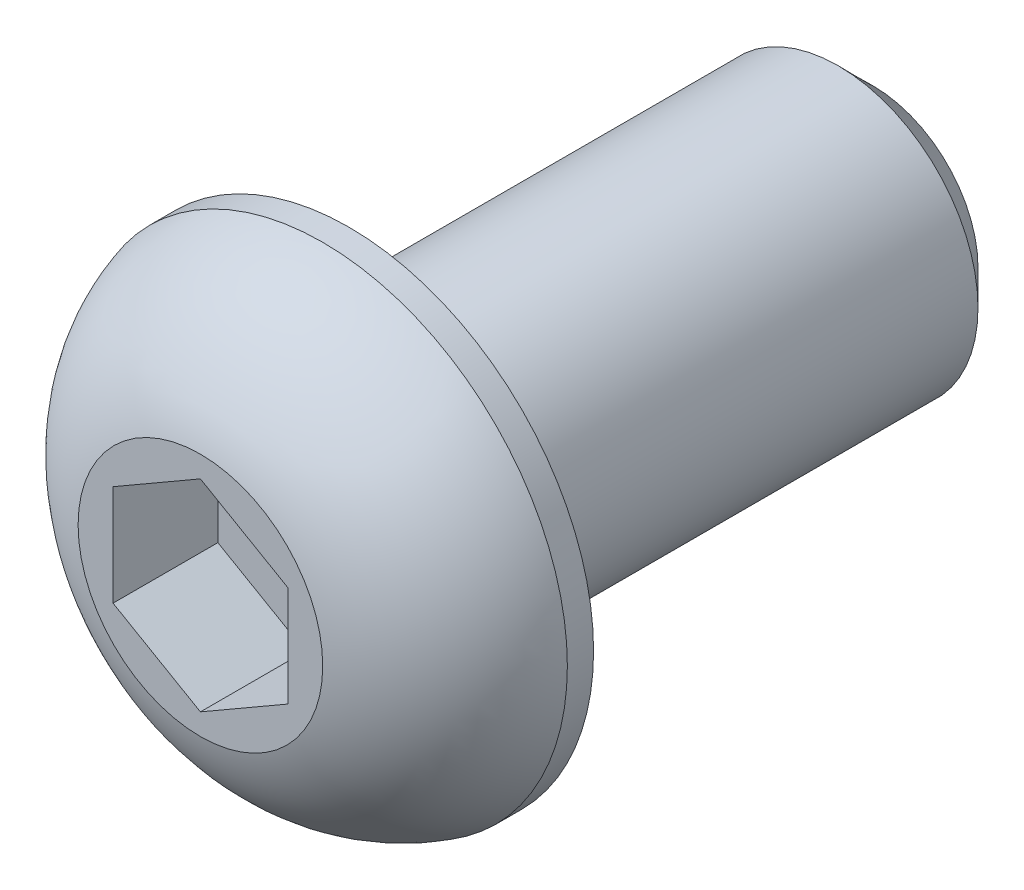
ISO-10303-21;
HEADER;
FILE_DESCRIPTION(('STEP AP214'),'2;1');
FILE_NAME('part.step','',(''),(''),'','','');
FILE_SCHEMA(('AUTOMOTIVE_DESIGN { 1 0 10303 214 1 1 1 1 }'));
ENDSEC;
DATA;
#1=APPLICATION_CONTEXT('core data for automotive mechanical design processes');
#2=APPLICATION_PROTOCOL_DEFINITION('international standard','automotive_design',2000,#1);
#3=PRODUCT_CONTEXT('',#1,'mechanical');
#4=PRODUCT('Part','Part','',(#3));
#5=PRODUCT_RELATED_PRODUCT_CATEGORY('part','',(#4));
#6=PRODUCT_DEFINITION_FORMATION('','',#4);
#7=PRODUCT_DEFINITION_CONTEXT('part definition',#1,'design');
#8=PRODUCT_DEFINITION('design','',#6,#7);
#9=PRODUCT_DEFINITION_SHAPE('','',#8);
#10=(LENGTH_UNIT() NAMED_UNIT(*) SI_UNIT(.MILLI.,.METRE.));
#11=(NAMED_UNIT(*) PLANE_ANGLE_UNIT() SI_UNIT($,.RADIAN.));
#12=(NAMED_UNIT(*) SI_UNIT($,.STERADIAN.) SOLID_ANGLE_UNIT());
#13=UNCERTAINTY_MEASURE_WITH_UNIT(LENGTH_MEASURE(1.E-05),#10,'distance_accuracy_value','');
#14=(GEOMETRIC_REPRESENTATION_CONTEXT(3) GLOBAL_UNCERTAINTY_ASSIGNED_CONTEXT((#13)) GLOBAL_UNIT_ASSIGNED_CONTEXT((#10,
#11,#12)) REPRESENTATION_CONTEXT('',''));
#15=CARTESIAN_POINT('',(0.,0.,0.));
#16=DIRECTION('',(0.,0.,1.));
#17=DIRECTION('',(1.,0.,0.));
#18=AXIS2_PLACEMENT_3D('',#15,#16,#17);
#19=CARTESIAN_POINT('',(0.,-5.60133932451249E-13,8.50000000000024));
#20=DIRECTION('',(0.,0.,1.));
#21=DIRECTION('',(0.,-1.,0.));
#22=AXIS2_PLACEMENT_3D('',#19,#20,#21);
#23=PLANE('',#22);
#24=CARTESIAN_POINT('',(0.,3.45415925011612E-13,8.50000000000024));
#25=DIRECTION('',(0.,0.,1.));
#26=DIRECTION('',(0.,-1.,0.));
#27=AXIS2_PLACEMENT_3D('',#24,#25,#26);
#28=CIRCLE('',#27,6.99999999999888);
#29=CARTESIAN_POINT('',(0.,-6.99999999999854,8.50000000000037));
#30=VERTEX_POINT('',#29);
#31=EDGE_CURVE('E124',#30,#30,#28,.T.);
#32=ORIENTED_EDGE('',*,*,#31,.T.);
#33=EDGE_LOOP('',(#32));
#34=FACE_BOUND('',#33,.T.);
#35=DIRECTION('',(0.,-1.,0.));
#36=VECTOR('',#35,1.);
#37=CARTESIAN_POINT('',(5.,2.88675134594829,8.50000000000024));
#38=LINE('',#37,#36);
#39=CARTESIAN_POINT('',(5.,2.88675134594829,8.50000000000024));
#40=VERTEX_POINT('',#39);
#41=CARTESIAN_POINT('',(5.,-2.88675134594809,8.50000000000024));
#42=VERTEX_POINT('',#41);
#43=EDGE_CURVE('E85',#40,#42,#38,.T.);
#44=ORIENTED_EDGE('',*,*,#43,.T.);
#45=DIRECTION('',(-0.86602540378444,-0.5,0.));
#46=VECTOR('',#45,1.);
#47=CARTESIAN_POINT('',(5.,-2.88675134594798,8.50000000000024));
#48=LINE('',#47,#46);
#49=CARTESIAN_POINT('',(0.,-5.77350269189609,8.50000000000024));
#50=VERTEX_POINT('',#49);
#51=EDGE_CURVE('E30',#42,#50,#48,.T.);
#52=ORIENTED_EDGE('',*,*,#51,.T.);
#53=DIRECTION('',(0.86602540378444,-0.5,0.));
#54=VECTOR('',#53,1.);
#55=CARTESIAN_POINT('',(-5.,-2.88675134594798,8.50000000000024));
#56=LINE('',#55,#54);
#57=CARTESIAN_POINT('',(-5.,-2.88675134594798,8.50000000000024));
#58=VERTEX_POINT('',#57);
#59=EDGE_CURVE('E75',#58,#50,#56,.T.);
#60=ORIENTED_EDGE('',*,*,#59,.F.);
#61=DIRECTION('',(0.,-1.,0.));
#62=VECTOR('',#61,1.);
#63=CARTESIAN_POINT('',(-5.,2.88675134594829,8.50000000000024));
#64=LINE('',#63,#62);
#65=CARTESIAN_POINT('',(-5.,2.88675134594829,8.50000000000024));
#66=VERTEX_POINT('',#65);
#67=EDGE_CURVE('E80',#66,#58,#64,.T.);
#68=ORIENTED_EDGE('',*,*,#67,.F.);
#69=DIRECTION('',(0.86602540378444,0.5,0.));
#70=VECTOR('',#69,1.);
#71=CARTESIAN_POINT('',(-5.,2.88675134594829,8.50000000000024));
#72=LINE('',#71,#70);
#73=CARTESIAN_POINT('',(0.,5.77350269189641,8.50000000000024));
#74=VERTEX_POINT('',#73);
#75=EDGE_CURVE('E89',#66,#74,#72,.T.);
#76=ORIENTED_EDGE('',*,*,#75,.T.);
#77=DIRECTION('',(-0.86602540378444,0.5,0.));
#78=VECTOR('',#77,1.);
#79=CARTESIAN_POINT('',(5.,2.88675134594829,8.50000000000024));
#80=LINE('',#79,#78);
#81=EDGE_CURVE('E92',#40,#74,#80,.T.);
#82=ORIENTED_EDGE('',*,*,#81,.F.);
#83=EDGE_LOOP('',(#44,#52,#60,#68,#76,#82));
#84=FACE_BOUND('',#83,.T.);
#85=ADVANCED_FACE('F15',(#34,#84),#23,.T.);
#86=CARTESIAN_POINT('',(0.,5.63411768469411E-13,20.1755563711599));
#87=DIRECTION('',(0.,0.,1.));
#88=DIRECTION('',(0.,-1.,0.));
#89=AXIS2_PLACEMENT_3D('',#86,#87,#88);
#90=CYLINDRICAL_SURFACE('',#89,7.99999999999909);
#91=CARTESIAN_POINT('',(0.,1.86711310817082E-13,-1.07552855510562E-13));
#92=DIRECTION('',(0.,0.,1.));
#93=DIRECTION('',(0.,-1.,0.));
#94=AXIS2_PLACEMENT_3D('',#91,#92,#93);
#95=CIRCLE('',#94,7.99999999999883);
#96=CARTESIAN_POINT('',(0.,-7.99999999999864,0.));
#97=VERTEX_POINT('',#96);
#98=EDGE_CURVE('E10',#97,#97,#95,.T.);
#99=ORIENTED_EDGE('',*,*,#98,.F.);
#100=EDGE_LOOP('',(#99));
#101=FACE_BOUND('',#100,.T.);
#102=CARTESIAN_POINT('',(0.,-3.36080359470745E-13,-27.9999999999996));
#103=DIRECTION('',(0.,0.,1.));
#104=DIRECTION('',(0.,-1.,0.));
#105=AXIS2_PLACEMENT_3D('',#102,#103,#104);
#106=CIRCLE('',#105,7.99999999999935);
#107=CARTESIAN_POINT('',(0.,-7.99999999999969,-27.9999999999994));
#108=VERTEX_POINT('',#107);
#109=EDGE_CURVE('E71',#108,#108,#106,.T.);
#110=ORIENTED_EDGE('',*,*,#109,.T.);
#111=EDGE_LOOP('',(#110));
#112=FACE_BOUND('',#111,.T.);
#113=ADVANCED_FACE('F17',(#101,#112),#90,.T.);
#114=CARTESIAN_POINT('',(0.,13.9999999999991,-2.60208521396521E-13));
#115=DIRECTION('',(0.,0.,-1.));
#116=DIRECTION('',(0.,1.,0.));
#117=AXIS2_PLACEMENT_3D('',#114,#115,#116);
#118=PLANE('',#117);
#119=ORIENTED_EDGE('',*,*,#98,.T.);
#120=EDGE_LOOP('',(#119));
#121=FACE_BOUND('',#120,.T.);
#122=CARTESIAN_POINT('',(0.,1.86711310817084E-13,2.393918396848E-13));
#123=DIRECTION('',(0.,0.,1.));
#124=DIRECTION('',(0.,-1.,0.));
#125=AXIS2_PLACEMENT_3D('',#122,#123,#124);
#126=CIRCLE('',#125,13.9999999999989);
#127=CARTESIAN_POINT('',(0.,-13.9999999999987,5.00787674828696E-13));
#128=VERTEX_POINT('',#127);
#129=EDGE_CURVE('E23',#128,#128,#126,.T.);
#130=ORIENTED_EDGE('',*,*,#129,.F.);
#131=EDGE_LOOP('',(#130));
#132=FACE_BOUND('',#131,.T.);
#133=ADVANCED_FACE('F134',(#121,#132),#118,.T.);
#134=CARTESIAN_POINT('',(0.,5.63411768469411E-13,20.1755563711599));
#135=DIRECTION('',(0.,0.,1.));
#136=DIRECTION('',(0.,-1.,0.));
#137=AXIS2_PLACEMENT_3D('',#134,#135,#136);
#138=CYLINDRICAL_SURFACE('',#137,13.9999999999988);
#139=CARTESIAN_POINT('',(0.,2.14718007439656E-13,1.50000000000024));
#140=DIRECTION('',(0.,0.,1.));
#141=DIRECTION('',(0.,-1.,0.));
#142=AXIS2_PLACEMENT_3D('',#139,#140,#141);
#143=CIRCLE('',#142,13.9999999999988);
#144=CARTESIAN_POINT('',(0.,-13.9999999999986,1.5000000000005));
#145=VERTEX_POINT('',#144);
#146=EDGE_CURVE('E127',#145,#145,#143,.T.);
#147=ORIENTED_EDGE('',*,*,#146,.F.);
#148=EDGE_LOOP('',(#147));
#149=FACE_BOUND('',#148,.T.);
#150=ORIENTED_EDGE('',*,*,#129,.T.);
#151=EDGE_LOOP('',(#150));
#152=FACE_BOUND('',#151,.T.);
#153=ADVANCED_FACE('F132',(#149,#152),#138,.T.);
#154=CARTESIAN_POINT('',(0.,1.64980480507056E-13,-1.14410286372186));
#155=DIRECTION('',(0.,0.,1.));
#156=DIRECTION('',(0.,-1.,0.));
#157=AXIS2_PLACEMENT_3D('',#154,#155,#156);
#158=DEGENERATE_TOROIDAL_SURFACE('',#157,4.35589713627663,10.,.T.);
#159=ORIENTED_EDGE('',*,*,#31,.F.);
#160=EDGE_LOOP('',(#159));
#161=FACE_BOUND('',#160,.T.);
#162=ORIENTED_EDGE('',*,*,#146,.T.);
#163=EDGE_LOOP('',(#162));
#164=FACE_BOUND('',#163,.T.);
#165=ADVANCED_FACE('F143',(#161,#164),#158,.T.);
#166=CARTESIAN_POINT('',(0.,-5.60133932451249E-13,-30.));
#167=DIRECTION('',(0.,0.,1.));
#168=DIRECTION('',(0.,-1.,0.));
#169=AXIS2_PLACEMENT_3D('',#166,#167,#168);
#170=PLANE('',#169);
#171=CARTESIAN_POINT('',(0.,-3.73422621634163E-13,-29.9999999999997));
#172=DIRECTION('',(0.,0.,1.));
#173=DIRECTION('',(0.,-1.,0.));
#174=AXIS2_PLACEMENT_3D('',#171,#172,#173);
#175=CIRCLE('',#174,5.99999999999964);
#176=CARTESIAN_POINT('',(0.,-6.00000000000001,-29.9999999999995));
#177=VERTEX_POINT('',#176);
#178=EDGE_CURVE('E121',#177,#177,#175,.T.);
#179=ORIENTED_EDGE('',*,*,#178,.F.);
#180=EDGE_LOOP('',(#179));
#181=FACE_BOUND('',#180,.T.);
#182=ADVANCED_FACE('F155',(#181),#170,.F.);
#183=CARTESIAN_POINT('',(0.,-3.73422621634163E-13,-29.9999999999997));
#184=DIRECTION('',(0.,0.,1.));
#185=DIRECTION('',(0.,-1.,0.));
#186=AXIS2_PLACEMENT_3D('',#183,#184,#185);
#187=CONICAL_SURFACE('',#186,5.99999999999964,0.785398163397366);
#188=ORIENTED_EDGE('',*,*,#109,.F.);
#189=EDGE_LOOP('',(#188));
#190=FACE_BOUND('',#189,.T.);
#191=ORIENTED_EDGE('',*,*,#178,.T.);
#192=EDGE_LOOP('',(#191));
#193=FACE_BOUND('',#192,.T.);
#194=ADVANCED_FACE('F163',(#190,#193),#187,.T.);
#195=CARTESIAN_POINT('',(5.,-2.88675134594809,2.50000000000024));
#196=DIRECTION('',(-0.5,0.86602540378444,0.));
#197=DIRECTION('',(-0.86602540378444,-0.5,0.));
#198=AXIS2_PLACEMENT_3D('',#195,#196,#197);
#199=PLANE('',#198);
#200=DIRECTION('',(0.,0.,1.));
#201=VECTOR('',#200,1.);
#202=CARTESIAN_POINT('',(0.,-5.7735026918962,2.50000000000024));
#203=LINE('',#202,#201);
#204=CARTESIAN_POINT('',(0.,-5.7735026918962,2.50000000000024));
#205=VERTEX_POINT('',#204);
#206=EDGE_CURVE('E64',#205,#50,#203,.T.);
#207=ORIENTED_EDGE('',*,*,#206,.T.);
#208=ORIENTED_EDGE('',*,*,#51,.F.);
#209=DIRECTION('',(0.,0.,1.));
#210=VECTOR('',#209,1.);
#211=CARTESIAN_POINT('',(5.,-2.88675134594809,2.50000000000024));
#212=LINE('',#211,#210);
#213=CARTESIAN_POINT('',(5.,-2.88675134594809,2.50000000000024));
#214=VERTEX_POINT('',#213);
#215=EDGE_CURVE('E34',#214,#42,#212,.T.);
#216=ORIENTED_EDGE('',*,*,#215,.F.);
#217=DIRECTION('',(-0.86602540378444,-0.5,0.));
#218=VECTOR('',#217,1.);
#219=CARTESIAN_POINT('',(5.,-2.88675134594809,2.50000000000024));
#220=LINE('',#219,#218);
#221=EDGE_CURVE('E67',#214,#205,#220,.T.);
#222=ORIENTED_EDGE('',*,*,#221,.T.);
#223=EDGE_LOOP('',(#207,#208,#216,#222));
#224=FACE_BOUND('',#223,.T.);
#225=ADVANCED_FACE('F66',(#224),#199,.T.);
#226=CARTESIAN_POINT('',(-5.,-2.88675134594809,2.50000000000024));
#227=DIRECTION('',(-0.5,-0.86602540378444,0.));
#228=DIRECTION('',(0.86602540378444,-0.5,0.));
#229=AXIS2_PLACEMENT_3D('',#226,#227,#228);
#230=PLANE('',#229);
#231=DIRECTION('',(0.,0.,1.));
#232=VECTOR('',#231,1.);
#233=CARTESIAN_POINT('',(-5.,-2.88675134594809,2.50000000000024));
#234=LINE('',#233,#232);
#235=CARTESIAN_POINT('',(-5.,-2.88675134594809,2.50000000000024));
#236=VERTEX_POINT('',#235);
#237=EDGE_CURVE('E72',#236,#58,#234,.T.);
#238=ORIENTED_EDGE('',*,*,#237,.T.);
#239=ORIENTED_EDGE('',*,*,#59,.T.);
#240=ORIENTED_EDGE('',*,*,#206,.F.);
#241=DIRECTION('',(0.86602540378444,-0.5,0.));
#242=VECTOR('',#241,1.);
#243=CARTESIAN_POINT('',(-5.,-2.88675134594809,2.50000000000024));
#244=LINE('',#243,#242);
#245=EDGE_CURVE('E97',#236,#205,#244,.T.);
#246=ORIENTED_EDGE('',*,*,#245,.F.);
#247=EDGE_LOOP('',(#238,#239,#240,#246));
#248=FACE_BOUND('',#247,.T.);
#249=ADVANCED_FACE('F76',(#248),#230,.F.);
#250=CARTESIAN_POINT('',(-5.,2.88675134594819,2.50000000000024));
#251=DIRECTION('',(-1.,0.,0.));
#252=DIRECTION('',(0.,-1.,0.));
#253=AXIS2_PLACEMENT_3D('',#250,#251,#252);
#254=PLANE('',#253);
#255=DIRECTION('',(0.,0.,1.));
#256=VECTOR('',#255,1.);
#257=CARTESIAN_POINT('',(-5.,2.88675134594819,2.50000000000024));
#258=LINE('',#257,#256);
#259=CARTESIAN_POINT('',(-5.,2.88675134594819,2.50000000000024));
#260=VERTEX_POINT('',#259);
#261=EDGE_CURVE('E116',#260,#66,#258,.T.);
#262=ORIENTED_EDGE('',*,*,#261,.T.);
#263=ORIENTED_EDGE('',*,*,#67,.T.);
#264=ORIENTED_EDGE('',*,*,#237,.F.);
#265=DIRECTION('',(0.,-1.,0.));
#266=VECTOR('',#265,1.);
#267=CARTESIAN_POINT('',(-5.,2.88675134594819,2.50000000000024));
#268=LINE('',#267,#266);
#269=EDGE_CURVE('E99',#260,#236,#268,.T.);
#270=ORIENTED_EDGE('',*,*,#269,.F.);
#271=EDGE_LOOP('',(#262,#263,#264,#270));
#272=FACE_BOUND('',#271,.T.);
#273=ADVANCED_FACE('F184',(#272),#254,.F.);
#274=CARTESIAN_POINT('',(-5.,2.88675134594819,2.50000000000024));
#275=DIRECTION('',(0.5,-0.86602540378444,0.));
#276=DIRECTION('',(0.86602540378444,0.5,0.));
#277=AXIS2_PLACEMENT_3D('',#274,#275,#276);
#278=PLANE('',#277);
#279=DIRECTION('',(0.,0.,1.));
#280=VECTOR('',#279,1.);
#281=CARTESIAN_POINT('',(0.,5.7735026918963,2.50000000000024));
#282=LINE('',#281,#280);
#283=CARTESIAN_POINT('',(0.,5.7735026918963,2.50000000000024));
#284=VERTEX_POINT('',#283);
#285=EDGE_CURVE('E114',#284,#74,#282,.T.);
#286=ORIENTED_EDGE('',*,*,#285,.T.);
#287=ORIENTED_EDGE('',*,*,#75,.F.);
#288=ORIENTED_EDGE('',*,*,#261,.F.);
#289=DIRECTION('',(0.86602540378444,0.5,0.));
#290=VECTOR('',#289,1.);
#291=CARTESIAN_POINT('',(-5.,2.88675134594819,2.50000000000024));
#292=LINE('',#291,#290);
#293=EDGE_CURVE('E102',#260,#284,#292,.T.);
#294=ORIENTED_EDGE('',*,*,#293,.T.);
#295=EDGE_LOOP('',(#286,#287,#288,#294));
#296=FACE_BOUND('',#295,.T.);
#297=ADVANCED_FACE('F187',(#296),#278,.T.);
#298=CARTESIAN_POINT('',(5.,2.88675134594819,2.50000000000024));
#299=DIRECTION('',(0.5,0.86602540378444,0.));
#300=DIRECTION('',(-0.86602540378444,0.5,0.));
#301=AXIS2_PLACEMENT_3D('',#298,#299,#300);
#302=PLANE('',#301);
#303=DIRECTION('',(0.,0.,1.));
#304=VECTOR('',#303,1.);
#305=CARTESIAN_POINT('',(5.,2.88675134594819,2.50000000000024));
#306=LINE('',#305,#304);
#307=CARTESIAN_POINT('',(5.,2.88675134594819,2.50000000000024));
#308=VERTEX_POINT('',#307);
#309=EDGE_CURVE('E112',#308,#40,#306,.T.);
#310=ORIENTED_EDGE('',*,*,#309,.T.);
#311=ORIENTED_EDGE('',*,*,#81,.T.);
#312=ORIENTED_EDGE('',*,*,#285,.F.);
#313=DIRECTION('',(-0.86602540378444,0.5,0.));
#314=VECTOR('',#313,1.);
#315=CARTESIAN_POINT('',(5.,2.88675134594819,2.50000000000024));
#316=LINE('',#315,#314);
#317=EDGE_CURVE('E105',#308,#284,#316,.T.);
#318=ORIENTED_EDGE('',*,*,#317,.F.);
#319=EDGE_LOOP('',(#310,#311,#312,#318));
#320=FACE_BOUND('',#319,.T.);
#321=ADVANCED_FACE('F191',(#320),#302,.F.);
#322=CARTESIAN_POINT('',(5.,2.88675134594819,2.50000000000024));
#323=DIRECTION('',(-1.,0.,0.));
#324=DIRECTION('',(0.,-1.,0.));
#325=AXIS2_PLACEMENT_3D('',#322,#323,#324);
#326=PLANE('',#325);
#327=DIRECTION('',(0.,-1.,0.));
#328=VECTOR('',#327,1.);
#329=CARTESIAN_POINT('',(5.,2.88675134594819,2.50000000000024));
#330=LINE('',#329,#328);
#331=EDGE_CURVE('E108',#308,#214,#330,.T.);
#332=ORIENTED_EDGE('',*,*,#331,.T.);
#333=ORIENTED_EDGE('',*,*,#215,.T.);
#334=ORIENTED_EDGE('',*,*,#43,.F.);
#335=ORIENTED_EDGE('',*,*,#309,.F.);
#336=EDGE_LOOP('',(#332,#333,#334,#335));
#337=FACE_BOUND('',#336,.T.);
#338=ADVANCED_FACE('F195',(#337),#326,.T.);
#339=CARTESIAN_POINT('',(-5.,-8.66025403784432,2.50000000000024));
#340=DIRECTION('',(0.,0.,1.));
#341=DIRECTION('',(0.,-1.,0.));
#342=AXIS2_PLACEMENT_3D('',#339,#340,#341);
#343=PLANE('',#342);
#344=ORIENTED_EDGE('',*,*,#221,.F.);
#345=ORIENTED_EDGE('',*,*,#331,.F.);
#346=ORIENTED_EDGE('',*,*,#317,.T.);
#347=ORIENTED_EDGE('',*,*,#293,.F.);
#348=ORIENTED_EDGE('',*,*,#269,.T.);
#349=ORIENTED_EDGE('',*,*,#245,.T.);
#350=EDGE_LOOP('',(#344,#345,#346,#347,#348,#349));
#351=FACE_BOUND('',#350,.T.);
#352=ADVANCED_FACE('F197',(#351),#343,.T.);
#353=CLOSED_SHELL('',(#85,#113,#133,#153,#165,#182,#194,#225,#249,#273,#297,#321,#338,#352));
#354=MANIFOLD_SOLID_BREP('B1',#353);
#355=ADVANCED_BREP_SHAPE_REPRESENTATION('',(#18,#354),#14);
#356=SHAPE_DEFINITION_REPRESENTATION(#9,#355);
ENDSEC;
END-ISO-10303-21;
